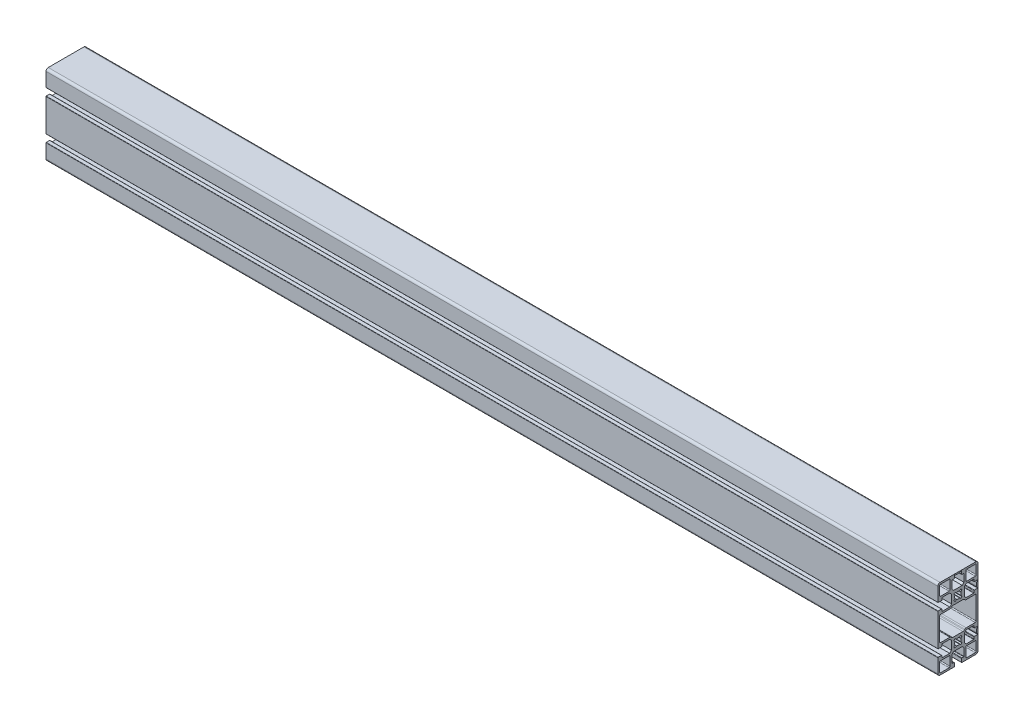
from build123d import *

# Parameters (mm, degrees)
F_45_SARJA_1_0110_45X90_VAHVA_L_6M_1_DEPTH = 1000


with BuildPart() as part:
    # Sketch1 → 45-sarja 1.0110 45X90 VAHVA L 6M_1 (new body)
    with BuildSketch(Plane(origin=(0, 0, 0), x_dir=(0, 0, -1), z_dir=(1, 0, 0))):
        with BuildLine():
            Line((-6.799999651, -40.199999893), (-6.799999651, -31.699999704))
            Line((-6.799999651, -31.699999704), (-4.799998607, -29.69999966))
            Line((-4.799998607, -29.69999966), (4.799999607, -29.69999966))
            Line((4.799999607, -29.69999966), (6.799999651, -31.699999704))
            Line((6.799999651, -31.699999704), (6.799999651, -40.199999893))
            ThreePointArc((6.799999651, -40.199999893), (6.712131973, -40.412131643), (6.500000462, -40.4999999))
            Line((6.500000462, -40.4999999), (4.60000042, -40.4999999))
            ThreePointArc((4.60000042, -40.4999999), (4.246447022, -40.646446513), (4.100000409, -40.999999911))
            Line((4.100000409, -40.999999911), (4.100000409, -44.699999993))
            ThreePointArc((4.100000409, -44.699999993), (4.187868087, -44.912131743), (4.399999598, -45))
            Line((4.399999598, -45), (19.999999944, -45))
            ThreePointArc((19.999999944, -45), (21.767766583, -44.26776729), (22.5, -42.500000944))
            Line((22.5, -42.500000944), (22.5, 42.500001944))
            ThreePointArc((22.5, 42.500001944), (21.76776623, 44.267767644), (19.999999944, 45))
            Line((19.999999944, 45), (-19.999999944, 45))
            ThreePointArc((-19.999999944, 45), (-21.76776623, 44.267767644), (-22.5, 42.500001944))
            Line((-22.5, 42.500001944), (-22.5, 26.900003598))
            ThreePointArc((-22.5, 26.900003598), (-22.412133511, 26.687868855), (-22.199999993, 26.599999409))
            Line((-22.199999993, 26.599999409), (-18.499999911, 26.599999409))
            ThreePointArc((-18.499999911, 26.599999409), (-18.146446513, 26.746446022), (-17.9999999, 27.09999942))
            Line((-17.9999999, 27.09999942), (-17.9999999, 28.999999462))
            ThreePointArc((-17.9999999, 28.999999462), (-17.912132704, 29.212132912), (-17.699999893, 29.300001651))
            Line((-17.699999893, 29.300001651), (-9.199999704, 29.300001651))
            Line((-9.199999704, 29.300001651), (-7.19999966, 27.300001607))
            Line((-7.19999966, 27.300001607), (-7.19999966, 17.699999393))
            Line((-7.19999966, 17.699999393), (-9.199999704, 15.699999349))
            Line((-9.199999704, 15.699999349), (-17.699999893, 15.699999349))
            ThreePointArc((-17.699999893, 15.699999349), (-17.912131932, 15.787867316), (-17.9999999, 15.999999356))
            Line((-17.9999999, 15.999999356), (-17.9999999, 17.900001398))
            ThreePointArc((-17.9999999, 17.900001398), (-18.14644722, 18.253553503), (-18.499999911, 18.399999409))
            Line((-18.499999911, 18.399999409), (-22.199999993, 18.399999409))
            ThreePointArc((-22.199999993, 18.399999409), (-22.412132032, 18.312131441), (-22.5, 18.099999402))
            Line((-22.5, 18.099999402), (-22.5, -18.100003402))
            ThreePointArc((-22.5, -18.100003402), (-22.412131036, -18.31213362), (-22.199999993, -18.400000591))
            Line((-22.199999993, -18.400000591), (-18.499999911, -18.400000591))
            ThreePointArc((-18.499999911, -18.400000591), (-18.146446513, -18.253553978), (-17.9999999, -17.90000058))
            Line((-17.9999999, -17.90000058), (-17.9999999, -16.000000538))
            ThreePointArc((-17.9999999, -16.000000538), (-17.912131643, -15.787869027), (-17.699999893, -15.700001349))
            Line((-17.699999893, -15.700001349), (-9.199999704, -15.700001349))
            Line((-9.199999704, -15.700001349), (-7.19999966, -17.700001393))
            Line((-7.19999966, -17.700001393), (-7.19999966, -27.299999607))
            Line((-7.19999966, -27.299999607), (-9.199999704, -29.300000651))
            Line((-9.199999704, -29.300000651), (-17.699999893, -29.300000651))
            ThreePointArc((-17.699999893, -29.300000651), (-17.912131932, -29.212132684), (-17.9999999, -29.000000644))
            Line((-17.9999999, -29.000000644), (-17.9999999, -27.100000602))
            ThreePointArc((-17.9999999, -27.100000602), (-18.146446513, -26.746447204), (-18.499999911, -26.600000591))
            Line((-18.499999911, -26.600000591), (-22.199999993, -26.600000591))
            ThreePointArc((-22.199999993, -26.600000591), (-22.412132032, -26.687868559), (-22.5, -26.900000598))
            Line((-22.5, -26.900000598), (-22.5, -42.500000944))
            ThreePointArc((-22.5, -42.500000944), (-21.767766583, -44.26776729), (-19.999999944, -45))
            Line((-19.999999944, -45), (-4.399999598, -45))
            ThreePointArc((-4.399999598, -45), (-4.187867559, -44.912132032), (-4.099999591, -44.699999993))
            Line((-4.099999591, -44.699999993), (-4.099999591, -40.999999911))
            ThreePointArc((-4.099999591, -40.999999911), (-4.246446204, -40.646446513), (-4.599999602, -40.4999999))
            Line((-4.599999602, -40.4999999), (-6.499999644, -40.4999999))
            ThreePointArc((-6.499999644, -40.4999999), (-6.712131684, -40.412131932), (-6.799999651, -40.199999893))
        make_face()
        with BuildLine():
            Line((20.500001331, -42.000000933), (20.500001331, -32.300018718))
            ThreePointArc((20.500001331, -32.300018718), (20.207108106, -31.592911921), (19.500001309, -31.300018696))
            Line((19.500001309, -31.300018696), (9.799989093, -31.300018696))
            ThreePointArc((9.799989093, -31.300018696), (9.092882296, -31.592911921), (8.799989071, -32.300018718))
            Line((8.799989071, -32.300018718), (8.799989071, -42.000000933))
            ThreePointArc((8.799989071, -42.000000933), (9.092882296, -42.70710773), (9.799989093, -43.000000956))
            Line((9.799989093, -43.000000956), (19.500001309, -43.000000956))
            ThreePointArc((19.500001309, -43.000000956), (20.207108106, -42.70710773), (20.500001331, -42.000000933))
        make_face(mode=Mode.SUBTRACT)
        with BuildLine():
            Line((-8.79998732, -42.000000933), (-8.79998732, -32.300018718))
            ThreePointArc((-8.79998732, -32.300018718), (-9.092880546, -31.592911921), (-9.799987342, -31.300018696))
            Line((-9.799987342, -31.300018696), (-19.499999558, -31.300018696))
            ThreePointArc((-19.499999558, -31.300018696), (-20.207106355, -31.592911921), (-20.49999958, -32.300018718))
            Line((-20.49999958, -32.300018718), (-20.49999958, -42.000000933))
            ThreePointArc((-20.49999958, -42.000000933), (-20.207106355, -42.70710773), (-19.499999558, -43.000000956))
            Line((-19.499999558, -43.000000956), (-9.799987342, -43.000000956))
            ThreePointArc((-9.799987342, -43.000000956), (-9.092880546, -42.70710773), (-8.79998732, -42.000000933))
        make_face(mode=Mode.SUBTRACT)
        with BuildLine():
            Line((22.200001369, -18.700000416), (22.200001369, -18.400001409))
            Line((22.200001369, -18.400001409), (18.500000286, -18.400001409))
            ThreePointArc((18.500000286, -18.400001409), (18.146446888, -18.253554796), (18.000000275, -17.900001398))
            Line((18.000000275, -17.900001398), (18.000000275, -16.000001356))
            ThreePointArc((18.000000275, -16.000001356), (17.912132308, -15.787869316), (17.700000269, -15.700001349))
            Line((17.700000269, -15.700001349), (9.20000108, -15.700001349))
            Line((9.20000108, -15.700001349), (7.200001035, -17.700001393))
            Line((7.200001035, -17.700001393), (7.200001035, -27.299999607))
            Line((7.200001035, -27.299999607), (9.20000108, -29.300000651))
            Line((9.20000108, -29.300000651), (17.700000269, -29.300000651))
            ThreePointArc((17.700000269, -29.300000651), (17.912132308, -29.212132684), (18.000000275, -29.000000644))
            Line((18.000000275, -29.000000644), (18.000000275, -27.100000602))
            ThreePointArc((18.000000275, -27.100000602), (18.146446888, -26.746447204), (18.500000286, -26.600000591))
            Line((18.500000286, -26.600000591), (22.200001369, -26.600000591))
            Line((22.200001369, -26.600000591), (22.200001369, -26.300000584))
            ThreePointArc((22.200001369, -26.300000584), (21.322060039, -25.437697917), (21.000001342, -24.250000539))
            Line((21.000001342, -24.250000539), (21.000001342, -20.750000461))
            ThreePointArc((21.000001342, -20.750000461), (21.322060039, -19.562303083), (22.200001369, -18.700000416))
        make_face(mode=Mode.SUBTRACT)
        with BuildLine():
            Line((-4.384062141, -19.530151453), (-3.363290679, -20.550922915))
            ThreePointArc((-3.363290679, -20.550922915), (-3.279575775, -20.713309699), (-3.305579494, -20.894145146))
            ThreePointArc((-3.305579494, -20.894145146), (-3.675000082, -22.5), (-3.305579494, -24.105854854))
            ThreePointArc((-3.305579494, -24.105854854), (-3.279575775, -24.286690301), (-3.363290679, -24.449077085))
            Line((-3.363290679, -24.449077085), (-4.384062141, -25.469848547))
            ThreePointArc((-4.384062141, -25.469848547), (-4.471930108, -25.681980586), (-4.384062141, -25.894112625))
            Line((-4.384062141, -25.894112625), (-3.394112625, -26.884062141))
            ThreePointArc((-3.394112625, -26.884062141), (-3.181980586, -26.971930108), (-2.969848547, -26.884062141))
            Line((-2.969848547, -26.884062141), (-1.949077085, -25.863290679))
            ThreePointArc((-1.949077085, -25.863290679), (-1.786690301, -25.779575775), (-1.605854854, -25.805579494))
            ThreePointArc((-1.605854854, -25.805579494), (0, -26.175000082), (1.605854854, -25.805579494))
            ThreePointArc((1.605854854, -25.805579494), (1.786690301, -25.779575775), (1.949077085, -25.863290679))
            Line((1.949077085, -25.863290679), (2.969848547, -26.884062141))
            ThreePointArc((2.969848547, -26.884062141), (3.181980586, -26.971930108), (3.394112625, -26.884062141))
            Line((3.394112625, -26.884062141), (4.384062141, -25.894112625))
            ThreePointArc((4.384062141, -25.894112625), (4.471930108, -25.681980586), (4.384062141, -25.469848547))
            Line((4.384062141, -25.469848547), (3.363290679, -24.449077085))
            ThreePointArc((3.363290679, -24.449077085), (3.279575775, -24.286690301), (3.305579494, -24.105854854))
            ThreePointArc((3.305579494, -24.105854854), (3.675000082, -22.5), (3.305579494, -20.894145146))
            ThreePointArc((3.305579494, -20.894145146), (3.279575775, -20.713309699), (3.363290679, -20.550922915))
            Line((3.363290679, -20.550922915), (4.384062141, -19.530151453))
            ThreePointArc((4.384062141, -19.530151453), (4.471930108, -19.318019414), (4.384062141, -19.105887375))
            Line((4.384062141, -19.105887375), (3.394112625, -18.115937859))
            ThreePointArc((3.394112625, -18.115937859), (3.181980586, -18.028069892), (2.969848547, -18.115937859))
            Line((2.969848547, -18.115937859), (1.949077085, -19.136709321))
            ThreePointArc((1.949077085, -19.136709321), (1.786690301, -19.220424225), (1.605854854, -19.194420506))
            ThreePointArc((1.605854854, -19.194420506), (0, -18.824999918), (-1.605854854, -19.194420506))
            ThreePointArc((-1.605854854, -19.194420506), (-1.786690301, -19.220424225), (-1.949077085, -19.136709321))
            Line((-1.949077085, -19.136709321), (-2.969848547, -18.115937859))
            ThreePointArc((-2.969848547, -18.115937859), (-3.181980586, -18.028069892), (-3.394112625, -18.115937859))
            Line((-3.394112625, -18.115937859), (-4.384062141, -19.105887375))
            ThreePointArc((-4.384062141, -19.105887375), (-4.471930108, -19.318019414), (-4.384062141, -19.530151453))
        make_face(mode=Mode.SUBTRACT)
        with BuildLine():
            Line((-20.49999958, 12.700012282), (-20.49999958, -12.700012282))
            ThreePointArc((-20.49999958, -12.700012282), (-20.207106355, -13.407119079), (-19.499999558, -13.700012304))
            Line((-19.499999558, -13.700012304), (-9.200011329, -13.700012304))
            ThreePointArc((-9.200011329, -13.700012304), (-8.434644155, -13.852253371), (-7.785797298, -14.285799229))
            Line((-7.785797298, -14.285799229), (-7.157379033, -14.914215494))
            ThreePointArc((-7.157379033, -14.914215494), (-6.508532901, -15.347759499), (-5.743167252, -15.499999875))
            Line((-5.743167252, -15.499999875), (5.743171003, -15.499999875))
            ThreePointArc((5.743171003, -15.499999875), (6.508537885, -15.347758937), (7.157384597, -14.914213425))
            Line((7.157384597, -14.914213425), (7.785800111, -14.28579791))
            ThreePointArc((7.785800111, -14.28579791), (8.434646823, -13.852252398), (9.200013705, -13.70001146))
            Line((9.200013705, -13.70001146), (19.500001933, -13.70001146))
            ThreePointArc((19.500001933, -13.70001146), (20.20710873, -13.407118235), (20.500001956, -12.700011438))
            Line((20.500001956, -12.700011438), (20.500001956, 12.700011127))
            ThreePointArc((20.500001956, 12.700011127), (20.20710873, 13.407117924), (19.500001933, 13.700011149))
            Line((19.500001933, 13.700011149), (9.200009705, 13.700011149))
            ThreePointArc((9.200009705, 13.700011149), (8.434642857, 13.852252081), (7.785796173, 14.285797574))
            Line((7.785796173, 14.285797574), (7.15738716, 14.914210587))
            ThreePointArc((7.15738716, 14.914210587), (6.508538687, 15.347759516), (5.743168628, 15.50000172))
            Line((5.743168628, 15.50000172), (-5.743169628, 15.50000172))
            ThreePointArc((-5.743169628, 15.50000172), (-6.508537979, 15.347760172), (-7.157385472, 14.914213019))
            Line((-7.157385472, 14.914213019), (-7.785795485, 14.285801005))
            ThreePointArc((-7.785795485, 14.285801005), (-8.434642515, 13.852254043), (-9.200010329, 13.700012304))
            Line((-9.200010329, 13.700012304), (-19.499999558, 13.700012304))
            ThreePointArc((-19.499999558, 13.700012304), (-20.207106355, 13.407119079), (-20.49999958, 12.700012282))
        make_face(mode=Mode.SUBTRACT)
        with BuildLine():
            Line((7.200001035, 27.300001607), (7.200001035, 17.699999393))
            Line((7.200001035, 17.699999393), (9.20000108, 15.699999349))
            Line((9.20000108, 15.699999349), (17.700000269, 15.699999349))
            ThreePointArc((17.700000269, 15.699999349), (17.912132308, 15.787867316), (18.000000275, 15.999999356))
            Line((18.000000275, 15.999999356), (18.000000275, 17.899999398))
            ThreePointArc((18.000000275, 17.899999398), (18.146446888, 18.253552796), (18.500000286, 18.399999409))
            Line((18.500000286, 18.399999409), (22.200001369, 18.399999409))
            Line((22.200001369, 18.399999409), (22.200001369, 18.699999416))
            ThreePointArc((22.200001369, 18.699999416), (21.322060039, 19.562302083), (21.000001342, 20.749999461))
            Line((21.000001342, 20.749999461), (21.000001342, 24.249999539))
            ThreePointArc((21.000001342, 24.249999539), (21.322060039, 25.437696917), (22.200001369, 26.299999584))
            Line((22.200001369, 26.299999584), (22.200001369, 26.600001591))
            Line((22.200001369, 26.600001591), (18.500000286, 26.600001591))
            ThreePointArc((18.500000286, 26.600001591), (18.146447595, 26.746447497), (18.000000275, 27.099999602))
            Line((18.000000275, 27.099999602), (18.000000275, 29.000001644))
            ThreePointArc((18.000000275, 29.000001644), (17.912132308, 29.212133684), (17.700000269, 29.300001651))
            Line((17.700000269, 29.300001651), (9.20000108, 29.300001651))
            Line((9.20000108, 29.300001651), (7.200001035, 27.300001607))
        make_face(mode=Mode.SUBTRACT)
        with BuildLine():
            Line((-4.384062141, 25.469848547), (-3.363290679, 24.449077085))
            ThreePointArc((-3.363290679, 24.449077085), (-3.279575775, 24.286690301), (-3.305579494, 24.105854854))
            ThreePointArc((-3.305579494, 24.105854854), (-3.675000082, 22.5), (-3.305579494, 20.894145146))
            ThreePointArc((-3.305579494, 20.894145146), (-3.279575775, 20.713309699), (-3.363290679, 20.550922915))
            Line((-3.363290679, 20.550922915), (-4.384062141, 19.530151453))
            ThreePointArc((-4.384062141, 19.530151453), (-4.471930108, 19.318019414), (-4.384062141, 19.105887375))
            Line((-4.384062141, 19.105887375), (-3.394112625, 18.115937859))
            ThreePointArc((-3.394112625, 18.115937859), (-3.181980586, 18.028069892), (-2.969848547, 18.115937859))
            Line((-2.969848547, 18.115937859), (-1.949077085, 19.136709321))
            ThreePointArc((-1.949077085, 19.136709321), (-1.786690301, 19.220424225), (-1.605854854, 19.194420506))
            ThreePointArc((-1.605854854, 19.194420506), (0, 18.824999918), (1.605854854, 19.194420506))
            ThreePointArc((1.605854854, 19.194420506), (1.786690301, 19.220424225), (1.949077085, 19.136709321))
            Line((1.949077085, 19.136709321), (2.969848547, 18.115937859))
            ThreePointArc((2.969848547, 18.115937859), (3.181980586, 18.028069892), (3.394112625, 18.115937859))
            Line((3.394112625, 18.115937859), (4.384062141, 19.105887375))
            ThreePointArc((4.384062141, 19.105887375), (4.471930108, 19.318019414), (4.384062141, 19.530151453))
            Line((4.384062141, 19.530151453), (3.363290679, 20.550922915))
            ThreePointArc((3.363290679, 20.550922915), (3.279575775, 20.713309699), (3.305579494, 20.894145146))
            ThreePointArc((3.305579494, 20.894145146), (3.675000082, 22.5), (3.305579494, 24.105854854))
            ThreePointArc((3.305579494, 24.105854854), (3.279575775, 24.286690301), (3.363290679, 24.449077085))
            Line((3.363290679, 24.449077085), (4.384062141, 25.469848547))
            ThreePointArc((4.384062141, 25.469848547), (4.471930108, 25.681980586), (4.384062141, 25.894112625))
            Line((4.384062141, 25.894112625), (3.394112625, 26.884062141))
            ThreePointArc((3.394112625, 26.884062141), (3.181980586, 26.971930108), (2.969848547, 26.884062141))
            Line((2.969848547, 26.884062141), (1.949077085, 25.863290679))
            ThreePointArc((1.949077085, 25.863290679), (1.786690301, 25.779575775), (1.605854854, 25.805579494))
            ThreePointArc((1.605854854, 25.805579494), (0, 26.175000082), (-1.605854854, 25.805579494))
            ThreePointArc((-1.605854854, 25.805579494), (-1.786690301, 25.779575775), (-1.949077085, 25.863290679))
            Line((-1.949077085, 25.863290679), (-2.969848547, 26.884062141))
            ThreePointArc((-2.969848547, 26.884062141), (-3.181980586, 26.971930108), (-3.394112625, 26.884062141))
            Line((-3.394112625, 26.884062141), (-4.384062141, 25.894112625))
            ThreePointArc((-4.384062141, 25.894112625), (-4.471930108, 25.681980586), (-4.384062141, 25.469848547))
        make_face(mode=Mode.SUBTRACT)
        with BuildLine():
            Line((20.500001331, 32.300018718), (20.500001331, 42.000000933))
            ThreePointArc((20.500001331, 42.000000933), (20.207108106, 42.70710773), (19.500001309, 43.000000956))
            Line((19.500001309, 43.000000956), (9.799989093, 43.000000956))
            ThreePointArc((9.799989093, 43.000000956), (9.092882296, 42.70710773), (8.799989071, 42.000000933))
            Line((8.799989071, 42.000000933), (8.799989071, 32.300018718))
            ThreePointArc((8.799989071, 32.300018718), (9.092882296, 31.592911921), (9.799989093, 31.300018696))
            Line((9.799989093, 31.300018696), (19.500001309, 31.300018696))
            ThreePointArc((19.500001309, 31.300018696), (20.207108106, 31.592911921), (20.500001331, 32.300018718))
        make_face(mode=Mode.SUBTRACT)
        with BuildLine():
            Line((-3.799999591, 44.7), (-4.099999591, 44.7))
            Line((-4.099999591, 44.7), (-4.099999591, 40.999999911))
            ThreePointArc((-4.099999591, 40.999999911), (-4.246446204, 40.646446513), (-4.599999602, 40.4999999))
            Line((-4.599999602, 40.4999999), (-6.499999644, 40.4999999))
            ThreePointArc((-6.499999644, 40.4999999), (-6.712131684, 40.412131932), (-6.799999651, 40.199999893))
            Line((-6.799999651, 40.199999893), (-6.799999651, 31.699996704))
            Line((-6.799999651, 31.699996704), (-4.799998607, 29.69999666))
            Line((-4.799998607, 29.69999666), (4.799999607, 29.69999666))
            Line((4.799999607, 29.69999666), (6.799999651, 31.699996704))
            Line((6.799999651, 31.699996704), (6.799999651, 40.199999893))
            ThreePointArc((6.799999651, 40.199999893), (6.712131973, 40.412131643), (6.500000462, 40.4999999))
            Line((6.500000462, 40.4999999), (4.60000042, 40.4999999))
            ThreePointArc((4.60000042, 40.4999999), (4.246447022, 40.646446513), (4.100000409, 40.999999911))
            Line((4.100000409, 40.999999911), (4.100000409, 44.7))
            Line((4.100000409, 44.7), (3.799390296, 44.7))
            ThreePointArc((3.799390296, 44.7), (2.937434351, 43.822070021), (1.750000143, 43.5))
            Line((1.750000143, 43.5), (-1.749999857, 43.5))
            ThreePointArc((-1.749999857, 43.5), (-2.937697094, 43.822058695), (-3.799999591, 44.7))
        make_face(mode=Mode.SUBTRACT)
        with BuildLine():
            Line((-20.49999958, 42.000000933), (-20.49999958, 32.300018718))
            ThreePointArc((-20.49999958, 32.300018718), (-20.207106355, 31.592911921), (-19.499999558, 31.300018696))
            Line((-19.499999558, 31.300018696), (-9.799987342, 31.300018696))
            ThreePointArc((-9.799987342, 31.300018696), (-9.092880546, 31.592911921), (-8.79998732, 32.300018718))
            Line((-8.79998732, 32.300018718), (-8.79998732, 42.000000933))
            ThreePointArc((-8.79998732, 42.000000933), (-9.092880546, 42.70710773), (-9.799987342, 43.000000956))
            Line((-9.799987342, 43.000000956), (-19.499999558, 43.000000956))
            ThreePointArc((-19.499999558, 43.000000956), (-20.207106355, 42.70710773), (-20.49999958, 42.000000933))
        make_face(mode=Mode.SUBTRACT)
    extrude(amount=F_45_SARJA_1_0110_45X90_VAHVA_L_6M_1_DEPTH)


solid = part.part
